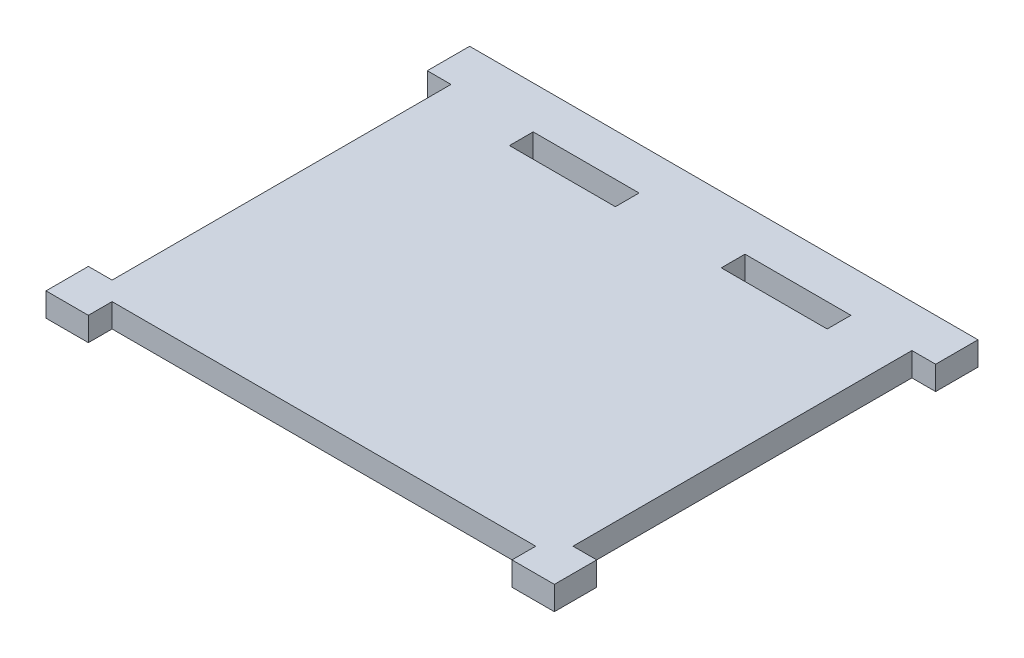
from build123d import *

# Parameters (mm, degrees)
SKETCH1_W           = 60
SKETCH1_H           = 50
SKETCH1_W_2         = 12.5
SKETCH1_H_2         = 2.8
BOSS_EXTRUDE1_DEPTH = 2.8
SKETCH3_W           = 2.8
SKETCH3_H           = 40
SKETCH3_W_2         = 50
SKETCH3_H_2         = 2.8
CUT_EXTRUDE2_DEPTH  = 2.8


with BuildPart() as part:
    # Sketch1 → Boss-Extrude1 (new body)
    with BuildSketch(Plane(origin=(0, 0, 0), x_dir=(1, 0, 0), z_dir=(0, 1, 0))):
        with Locations((30, 25)):
            Rectangle(SKETCH1_W, SKETCH1_H)
        with Locations((18.75, 43.6)):
            Rectangle(SKETCH1_W_2, SKETCH1_H_2, mode=Mode.SUBTRACT)
        with Locations((43.75, 43.6)):
            Rectangle(SKETCH1_W_2, SKETCH1_H_2, mode=Mode.SUBTRACT)
    extrude(amount=BOSS_EXTRUDE1_DEPTH)

    # Sketch3 → Cut-Extrude2 (cut)
    with BuildSketch(Plane(origin=(0, 2.8, 0), x_dir=(1, 0, 0), z_dir=(0, 1, 0))):
        with Locations((1.4, 25)):
            Rectangle(SKETCH3_W, SKETCH3_H)
        with Locations((30, 1.4)):
            Rectangle(SKETCH3_W_2, SKETCH3_H_2)
        with Locations((58.6, 25)):
            Rectangle(SKETCH3_W, SKETCH3_H)
    extrude(amount=-CUT_EXTRUDE2_DEPTH, mode=Mode.SUBTRACT)


solid = part.part
